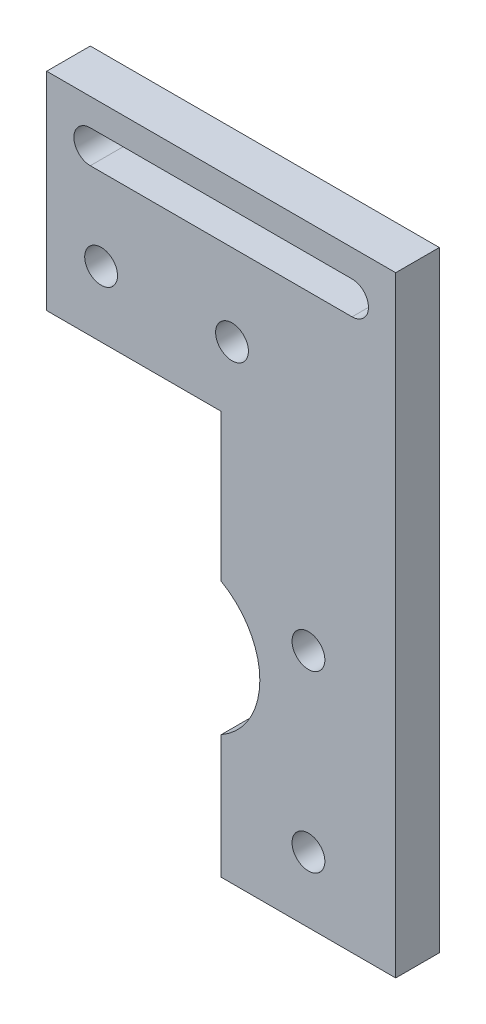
ISO-10303-21;
HEADER;
FILE_DESCRIPTION(('STEP AP214'),'2;1');
FILE_NAME('part.step','',(''),(''),'','','');
FILE_SCHEMA(('AUTOMOTIVE_DESIGN { 1 0 10303 214 1 1 1 1 }'));
ENDSEC;
DATA;
#1=APPLICATION_CONTEXT('core data for automotive mechanical design processes');
#2=APPLICATION_PROTOCOL_DEFINITION('international standard','automotive_design',2000,#1);
#3=PRODUCT_CONTEXT('',#1,'mechanical');
#4=PRODUCT('Part','Part','',(#3));
#5=PRODUCT_RELATED_PRODUCT_CATEGORY('part','',(#4));
#6=PRODUCT_DEFINITION_FORMATION('','',#4);
#7=PRODUCT_DEFINITION_CONTEXT('part definition',#1,'design');
#8=PRODUCT_DEFINITION('design','',#6,#7);
#9=PRODUCT_DEFINITION_SHAPE('','',#8);
#10=(LENGTH_UNIT() NAMED_UNIT(*) SI_UNIT(.MILLI.,.METRE.));
#11=(NAMED_UNIT(*) PLANE_ANGLE_UNIT() SI_UNIT($,.RADIAN.));
#12=(NAMED_UNIT(*) SI_UNIT($,.STERADIAN.) SOLID_ANGLE_UNIT());
#13=UNCERTAINTY_MEASURE_WITH_UNIT(LENGTH_MEASURE(1.E-05),#10,'distance_accuracy_value','');
#14=(GEOMETRIC_REPRESENTATION_CONTEXT(3) GLOBAL_UNCERTAINTY_ASSIGNED_CONTEXT((#13)) GLOBAL_UNIT_ASSIGNED_CONTEXT((#10,
#11,#12)) REPRESENTATION_CONTEXT('',''));
#15=CARTESIAN_POINT('',(0.,0.,0.));
#16=DIRECTION('',(0.,0.,1.));
#17=DIRECTION('',(1.,0.,0.));
#18=AXIS2_PLACEMENT_3D('',#15,#16,#17);
#19=CARTESIAN_POINT('',(0.,0.,6.35));
#20=DIRECTION('',(0.,0.,1.));
#21=DIRECTION('',(1.,0.,0.));
#22=AXIS2_PLACEMENT_3D('',#19,#20,#21);
#23=PLANE('',#22);
#24=DIRECTION('',(1.,0.,0.));
#25=VECTOR('',#24,1.);
#26=CARTESIAN_POINT('',(-31.75,70.6374,6.35));
#27=LINE('',#26,#25);
#28=CARTESIAN_POINT('',(-31.75,70.6374,6.35));
#29=VERTEX_POINT('',#28);
#30=CARTESIAN_POINT('',(6.35,70.6374,6.35));
#31=VERTEX_POINT('',#30);
#32=EDGE_CURVE('E250',#29,#31,#27,.T.);
#33=ORIENTED_EDGE('',*,*,#32,.F.);
#34=CARTESIAN_POINT('',(-31.75,73.025,6.35));
#35=DIRECTION('',(0.,0.,1.));
#36=DIRECTION('',(1.,0.,0.));
#37=AXIS2_PLACEMENT_3D('',#34,#35,#36);
#38=CIRCLE('',#37,2.38759999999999);
#39=CARTESIAN_POINT('',(-31.75,75.4126,6.35));
#40=VERTEX_POINT('',#39);
#41=EDGE_CURVE('E237',#40,#29,#38,.T.);
#42=ORIENTED_EDGE('',*,*,#41,.F.);
#43=DIRECTION('',(-1.,0.,0.));
#44=VECTOR('',#43,1.);
#45=CARTESIAN_POINT('',(-31.75,75.4126,6.35));
#46=LINE('',#45,#44);
#47=CARTESIAN_POINT('',(6.35,75.4126,6.35));
#48=VERTEX_POINT('',#47);
#49=EDGE_CURVE('E233',#48,#40,#46,.T.);
#50=ORIENTED_EDGE('',*,*,#49,.F.);
#51=CARTESIAN_POINT('',(6.35,73.025,6.35));
#52=DIRECTION('',(0.,0.,1.));
#53=DIRECTION('',(1.,0.,0.));
#54=AXIS2_PLACEMENT_3D('',#51,#52,#53);
#55=CIRCLE('',#54,2.38759999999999);
#56=EDGE_CURVE('E248',#31,#48,#55,.T.);
#57=ORIENTED_EDGE('',*,*,#56,.F.);
#58=EDGE_LOOP('',(#33,#42,#50,#57));
#59=FACE_BOUND('',#58,.T.);
#60=CARTESIAN_POINT('',(-30.1752,58.7502,6.35));
#61=DIRECTION('',(0.,0.,1.));
#62=DIRECTION('',(1.,0.,0.));
#63=AXIS2_PLACEMENT_3D('',#60,#61,#62);
#64=CIRCLE('',#63,2.3876);
#65=CARTESIAN_POINT('',(-27.7876,58.7502,6.35));
#66=VERTEX_POINT('',#65);
#67=EDGE_CURVE('E210',#66,#66,#64,.T.);
#68=ORIENTED_EDGE('',*,*,#67,.F.);
#69=EDGE_LOOP('',(#68));
#70=FACE_BOUND('',#69,.T.);
#71=CARTESIAN_POINT('',(0.,0.,6.35));
#72=DIRECTION('',(0.,0.,1.));
#73=DIRECTION('',(1.,0.,0.));
#74=AXIS2_PLACEMENT_3D('',#71,#72,#73);
#75=CIRCLE('',#74,2.3876);
#76=CARTESIAN_POINT('',(2.3876,0.,6.35));
#77=VERTEX_POINT('',#76);
#78=EDGE_CURVE('E144',#77,#77,#75,.T.);
#79=ORIENTED_EDGE('',*,*,#78,.F.);
#80=EDGE_LOOP('',(#79));
#81=FACE_BOUND('',#80,.T.);
#82=CARTESIAN_POINT('',(0.,25.4,6.35));
#83=DIRECTION('',(0.,0.,1.));
#84=DIRECTION('',(1.,0.,0.));
#85=AXIS2_PLACEMENT_3D('',#82,#83,#84);
#86=CIRCLE('',#85,2.3876);
#87=CARTESIAN_POINT('',(2.3876,25.4,6.35));
#88=VERTEX_POINT('',#87);
#89=EDGE_CURVE('E204',#88,#88,#86,.T.);
#90=ORIENTED_EDGE('',*,*,#89,.F.);
#91=EDGE_LOOP('',(#90));
#92=FACE_BOUND('',#91,.T.);
#93=CARTESIAN_POINT('',(-11.1252,58.7502,6.35));
#94=DIRECTION('',(0.,0.,1.));
#95=DIRECTION('',(1.,0.,0.));
#96=AXIS2_PLACEMENT_3D('',#93,#94,#95);
#97=CIRCLE('',#96,2.3876);
#98=CARTESIAN_POINT('',(-8.73759999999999,58.7502,6.35));
#99=VERTEX_POINT('',#98);
#100=EDGE_CURVE('E216',#99,#99,#97,.T.);
#101=ORIENTED_EDGE('',*,*,#100,.F.);
#102=EDGE_LOOP('',(#101));
#103=FACE_BOUND('',#102,.T.);
#104=DIRECTION('',(0.,-1.,0.));
#105=VECTOR('',#104,1.);
#106=CARTESIAN_POINT('',(-12.7,49.1998,6.35));
#107=LINE('',#106,#105);
#108=CARTESIAN_POINT('',(-12.7,49.1998,6.35));
#109=VERTEX_POINT('',#108);
#110=CARTESIAN_POINT('',(-12.7,27.7738986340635,6.35));
#111=VERTEX_POINT('',#110);
#112=EDGE_CURVE('E199',#109,#111,#107,.T.);
#113=ORIENTED_EDGE('',*,*,#112,.T.);
#114=CARTESIAN_POINT('',(-18.1864,18.1102,6.35));
#115=DIRECTION('',(0.,0.,1.));
#116=DIRECTION('',(1.,0.,0.));
#117=AXIS2_PLACEMENT_3D('',#114,#115,#116);
#118=CIRCLE('',#117,11.1125);
#119=CARTESIAN_POINT('',(-12.7,8.44650136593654,6.35));
#120=VERTEX_POINT('',#119);
#121=EDGE_CURVE('E47',#111,#120,#118,.F.);
#122=ORIENTED_EDGE('',*,*,#121,.T.);
#123=CARTESIAN_POINT('',(-12.7,-9.525,6.35));
#124=VERTEX_POINT('',#123);
#125=EDGE_CURVE('E156',#120,#124,#107,.T.);
#126=ORIENTED_EDGE('',*,*,#125,.T.);
#127=DIRECTION('',(1.,0.,0.));
#128=VECTOR('',#127,1.);
#129=CARTESIAN_POINT('',(-12.7,-9.525,6.35));
#130=LINE('',#129,#128);
#131=CARTESIAN_POINT('',(12.7,-9.525,6.35));
#132=VERTEX_POINT('',#131);
#133=EDGE_CURVE('E176',#124,#132,#130,.T.);
#134=ORIENTED_EDGE('',*,*,#133,.T.);
#135=DIRECTION('',(0.,1.,0.));
#136=VECTOR('',#135,1.);
#137=CARTESIAN_POINT('',(12.7,-9.525,6.35));
#138=LINE('',#137,#136);
#139=CARTESIAN_POINT('',(12.7,79.375,6.35));
#140=VERTEX_POINT('',#139);
#141=EDGE_CURVE('E194',#132,#140,#138,.T.);
#142=ORIENTED_EDGE('',*,*,#141,.T.);
#143=DIRECTION('',(-1.,0.,0.));
#144=VECTOR('',#143,1.);
#145=CARTESIAN_POINT('',(12.7,79.375,6.35));
#146=LINE('',#145,#144);
#147=CARTESIAN_POINT('',(-38.1,79.375,6.35));
#148=VERTEX_POINT('',#147);
#149=EDGE_CURVE('E190',#140,#148,#146,.T.);
#150=ORIENTED_EDGE('',*,*,#149,.T.);
#151=DIRECTION('',(0.,-1.,0.));
#152=VECTOR('',#151,1.);
#153=CARTESIAN_POINT('',(-38.1,79.375,6.35));
#154=LINE('',#153,#152);
#155=CARTESIAN_POINT('',(-38.1,49.1998,6.35));
#156=VERTEX_POINT('',#155);
#157=EDGE_CURVE('E193',#148,#156,#154,.T.);
#158=ORIENTED_EDGE('',*,*,#157,.T.);
#159=DIRECTION('',(1.,0.,0.));
#160=VECTOR('',#159,1.);
#161=CARTESIAN_POINT('',(-38.1,49.1998,6.35));
#162=LINE('',#161,#160);
#163=EDGE_CURVE('E146',#156,#109,#162,.T.);
#164=ORIENTED_EDGE('',*,*,#163,.T.);
#165=EDGE_LOOP('',(#113,#122,#126,#134,#142,#150,#158,#164));
#166=FACE_BOUND('',#165,.T.);
#167=ADVANCED_FACE('F33',(#59,#70,#81,#92,#103,#166),#23,.T.);
#168=CARTESIAN_POINT('',(0.,0.,0.));
#169=DIRECTION('',(0.,0.,1.));
#170=DIRECTION('',(1.,0.,0.));
#171=AXIS2_PLACEMENT_3D('',#168,#169,#170);
#172=PLANE('',#171);
#173=CARTESIAN_POINT('',(-31.75,73.025,0.));
#174=DIRECTION('',(0.,0.,1.));
#175=DIRECTION('',(1.,0.,0.));
#176=AXIS2_PLACEMENT_3D('',#173,#174,#175);
#177=CIRCLE('',#176,2.38759999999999);
#178=CARTESIAN_POINT('',(-31.75,75.4126,0.));
#179=VERTEX_POINT('',#178);
#180=CARTESIAN_POINT('',(-31.75,70.6374,0.));
#181=VERTEX_POINT('',#180);
#182=EDGE_CURVE('E244',#179,#181,#177,.T.);
#183=ORIENTED_EDGE('',*,*,#182,.T.);
#184=DIRECTION('',(1.,0.,0.));
#185=VECTOR('',#184,1.);
#186=CARTESIAN_POINT('',(-31.75,70.6374,0.));
#187=LINE('',#186,#185);
#188=CARTESIAN_POINT('',(6.35,70.6374,0.));
#189=VERTEX_POINT('',#188);
#190=EDGE_CURVE('E241',#181,#189,#187,.T.);
#191=ORIENTED_EDGE('',*,*,#190,.T.);
#192=CARTESIAN_POINT('',(6.35,73.025,0.));
#193=DIRECTION('',(0.,0.,1.));
#194=DIRECTION('',(1.,0.,0.));
#195=AXIS2_PLACEMENT_3D('',#192,#193,#194);
#196=CIRCLE('',#195,2.38759999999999);
#197=CARTESIAN_POINT('',(6.35,75.4126,0.));
#198=VERTEX_POINT('',#197);
#199=EDGE_CURVE('E238',#189,#198,#196,.T.);
#200=ORIENTED_EDGE('',*,*,#199,.T.);
#201=DIRECTION('',(-1.,0.,0.));
#202=VECTOR('',#201,1.);
#203=CARTESIAN_POINT('',(-31.75,75.4126,0.));
#204=LINE('',#203,#202);
#205=EDGE_CURVE('E234',#198,#179,#204,.T.);
#206=ORIENTED_EDGE('',*,*,#205,.T.);
#207=EDGE_LOOP('',(#183,#191,#200,#206));
#208=FACE_BOUND('',#207,.T.);
#209=CARTESIAN_POINT('',(-30.1752,58.7502,0.));
#210=DIRECTION('',(0.,0.,1.));
#211=DIRECTION('',(1.,0.,0.));
#212=AXIS2_PLACEMENT_3D('',#209,#210,#211);
#213=CIRCLE('',#212,2.3876);
#214=CARTESIAN_POINT('',(-27.7876,58.7502,0.));
#215=VERTEX_POINT('',#214);
#216=EDGE_CURVE('E213',#215,#215,#213,.T.);
#217=ORIENTED_EDGE('',*,*,#216,.T.);
#218=EDGE_LOOP('',(#217));
#219=FACE_BOUND('',#218,.T.);
#220=CARTESIAN_POINT('',(0.,0.,0.));
#221=DIRECTION('',(0.,0.,1.));
#222=DIRECTION('',(1.,0.,0.));
#223=AXIS2_PLACEMENT_3D('',#220,#221,#222);
#224=CIRCLE('',#223,2.3876);
#225=CARTESIAN_POINT('',(2.3876,0.,0.));
#226=VERTEX_POINT('',#225);
#227=EDGE_CURVE('E201',#226,#226,#224,.T.);
#228=ORIENTED_EDGE('',*,*,#227,.T.);
#229=EDGE_LOOP('',(#228));
#230=FACE_BOUND('',#229,.T.);
#231=CARTESIAN_POINT('',(0.,25.4,0.));
#232=DIRECTION('',(0.,0.,1.));
#233=DIRECTION('',(1.,0.,0.));
#234=AXIS2_PLACEMENT_3D('',#231,#232,#233);
#235=CIRCLE('',#234,2.3876);
#236=CARTESIAN_POINT('',(2.3876,25.4,0.));
#237=VERTEX_POINT('',#236);
#238=EDGE_CURVE('E207',#237,#237,#235,.T.);
#239=ORIENTED_EDGE('',*,*,#238,.T.);
#240=EDGE_LOOP('',(#239));
#241=FACE_BOUND('',#240,.T.);
#242=CARTESIAN_POINT('',(-11.1252,58.7502,0.));
#243=DIRECTION('',(0.,0.,1.));
#244=DIRECTION('',(1.,0.,0.));
#245=AXIS2_PLACEMENT_3D('',#242,#243,#244);
#246=CIRCLE('',#245,2.3876);
#247=CARTESIAN_POINT('',(-8.73759999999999,58.7502,0.));
#248=VERTEX_POINT('',#247);
#249=EDGE_CURVE('E219',#248,#248,#246,.T.);
#250=ORIENTED_EDGE('',*,*,#249,.T.);
#251=EDGE_LOOP('',(#250));
#252=FACE_BOUND('',#251,.T.);
#253=CARTESIAN_POINT('',(-18.1864,18.1102,0.));
#254=DIRECTION('',(0.,0.,1.));
#255=DIRECTION('',(1.,0.,0.));
#256=AXIS2_PLACEMENT_3D('',#253,#254,#255);
#257=CIRCLE('',#256,11.1125);
#258=CARTESIAN_POINT('',(-12.7,8.44650136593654,0.));
#259=VERTEX_POINT('',#258);
#260=CARTESIAN_POINT('',(-12.7,27.7738986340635,0.));
#261=VERTEX_POINT('',#260);
#262=EDGE_CURVE('E120',#259,#261,#257,.T.);
#263=ORIENTED_EDGE('',*,*,#262,.T.);
#264=DIRECTION('',(0.,-1.,0.));
#265=VECTOR('',#264,1.);
#266=CARTESIAN_POINT('',(-12.7,49.1998,0.));
#267=LINE('',#266,#265);
#268=CARTESIAN_POINT('',(-12.7,49.1998,0.));
#269=VERTEX_POINT('',#268);
#270=EDGE_CURVE('E132',#269,#261,#267,.T.);
#271=ORIENTED_EDGE('',*,*,#270,.F.);
#272=DIRECTION('',(1.,0.,0.));
#273=VECTOR('',#272,1.);
#274=CARTESIAN_POINT('',(-38.1,49.1998,0.));
#275=LINE('',#274,#273);
#276=CARTESIAN_POINT('',(-38.1,49.1998,0.));
#277=VERTEX_POINT('',#276);
#278=EDGE_CURVE('E154',#277,#269,#275,.T.);
#279=ORIENTED_EDGE('',*,*,#278,.F.);
#280=DIRECTION('',(0.,-1.,0.));
#281=VECTOR('',#280,1.);
#282=CARTESIAN_POINT('',(-38.1,79.375,0.));
#283=LINE('',#282,#281);
#284=CARTESIAN_POINT('',(-38.1,79.375,0.));
#285=VERTEX_POINT('',#284);
#286=EDGE_CURVE('E152',#285,#277,#283,.T.);
#287=ORIENTED_EDGE('',*,*,#286,.F.);
#288=DIRECTION('',(-1.,0.,0.));
#289=VECTOR('',#288,1.);
#290=CARTESIAN_POINT('',(12.7,79.375,0.));
#291=LINE('',#290,#289);
#292=CARTESIAN_POINT('',(12.7,79.375,0.));
#293=VERTEX_POINT('',#292);
#294=EDGE_CURVE('E150',#293,#285,#291,.T.);
#295=ORIENTED_EDGE('',*,*,#294,.F.);
#296=DIRECTION('',(0.,1.,0.));
#297=VECTOR('',#296,1.);
#298=CARTESIAN_POINT('',(12.7,-9.525,0.));
#299=LINE('',#298,#297);
#300=CARTESIAN_POINT('',(12.7,-9.525,0.));
#301=VERTEX_POINT('',#300);
#302=EDGE_CURVE('E142',#301,#293,#299,.T.);
#303=ORIENTED_EDGE('',*,*,#302,.F.);
#304=DIRECTION('',(1.,0.,0.));
#305=VECTOR('',#304,1.);
#306=CARTESIAN_POINT('',(-12.7,-9.525,0.));
#307=LINE('',#306,#305);
#308=CARTESIAN_POINT('',(-12.7,-9.525,0.));
#309=VERTEX_POINT('',#308);
#310=EDGE_CURVE('E140',#309,#301,#307,.T.);
#311=ORIENTED_EDGE('',*,*,#310,.F.);
#312=EDGE_CURVE('E134',#259,#309,#267,.T.);
#313=ORIENTED_EDGE('',*,*,#312,.F.);
#314=EDGE_LOOP('',(#263,#271,#279,#287,#295,#303,#311,#313));
#315=FACE_BOUND('',#314,.T.);
#316=ADVANCED_FACE('F130',(#208,#219,#230,#241,#252,#315),#172,.F.);
#317=CARTESIAN_POINT('',(-12.7,49.1998,6.35));
#318=DIRECTION('',(1.,0.,0.));
#319=DIRECTION('',(0.,1.,0.));
#320=AXIS2_PLACEMENT_3D('',#317,#318,#319);
#321=PLANE('',#320);
#322=DIRECTION('',(0.,0.,-1.));
#323=VECTOR('',#322,1.);
#324=CARTESIAN_POINT('',(-12.7,8.44650136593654,12.7));
#325=LINE('',#324,#323);
#326=EDGE_CURVE('E11',#259,#120,#325,.F.);
#327=ORIENTED_EDGE('',*,*,#326,.F.);
#328=ORIENTED_EDGE('',*,*,#312,.T.);
#329=DIRECTION('',(0.,0.,-1.));
#330=VECTOR('',#329,1.);
#331=CARTESIAN_POINT('',(-12.7,-9.525,6.35));
#332=LINE('',#331,#330);
#333=EDGE_CURVE('E126',#124,#309,#332,.T.);
#334=ORIENTED_EDGE('',*,*,#333,.F.);
#335=ORIENTED_EDGE('',*,*,#125,.F.);
#336=EDGE_LOOP('',(#327,#328,#334,#335));
#337=FACE_BOUND('',#336,.T.);
#338=ADVANCED_FACE('F35',(#337),#321,.F.);
#339=DIRECTION('',(0.,0.,-1.));
#340=VECTOR('',#339,1.);
#341=CARTESIAN_POINT('',(-12.7,27.7738986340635,12.7));
#342=LINE('',#341,#340);
#343=EDGE_CURVE('E41',#111,#261,#342,.T.);
#344=ORIENTED_EDGE('',*,*,#343,.F.);
#345=ORIENTED_EDGE('',*,*,#112,.F.);
#346=DIRECTION('',(0.,0.,-1.));
#347=VECTOR('',#346,1.);
#348=CARTESIAN_POINT('',(-12.7,49.1998,6.35));
#349=LINE('',#348,#347);
#350=EDGE_CURVE('E139',#109,#269,#349,.T.);
#351=ORIENTED_EDGE('',*,*,#350,.T.);
#352=ORIENTED_EDGE('',*,*,#270,.T.);
#353=EDGE_LOOP('',(#344,#345,#351,#352));
#354=FACE_BOUND('',#353,.T.);
#355=ADVANCED_FACE('F137',(#354),#321,.F.);
#356=CARTESIAN_POINT('',(-12.7,-9.525,6.35));
#357=DIRECTION('',(0.,1.,0.));
#358=DIRECTION('',(0.,0.,1.));
#359=AXIS2_PLACEMENT_3D('',#356,#357,#358);
#360=PLANE('',#359);
#361=ORIENTED_EDGE('',*,*,#310,.T.);
#362=DIRECTION('',(0.,0.,-1.));
#363=VECTOR('',#362,1.);
#364=CARTESIAN_POINT('',(12.7,-9.525,6.35));
#365=LINE('',#364,#363);
#366=EDGE_CURVE('E167',#132,#301,#365,.T.);
#367=ORIENTED_EDGE('',*,*,#366,.F.);
#368=ORIENTED_EDGE('',*,*,#133,.F.);
#369=ORIENTED_EDGE('',*,*,#333,.T.);
#370=EDGE_LOOP('',(#361,#367,#368,#369));
#371=FACE_BOUND('',#370,.T.);
#372=ADVANCED_FACE('F174',(#371),#360,.F.);
#373=CARTESIAN_POINT('',(12.7,-9.525,6.35));
#374=DIRECTION('',(-1.,0.,0.));
#375=DIRECTION('',(0.,-1.,0.));
#376=AXIS2_PLACEMENT_3D('',#373,#374,#375);
#377=PLANE('',#376);
#378=ORIENTED_EDGE('',*,*,#302,.T.);
#379=DIRECTION('',(0.,0.,-1.));
#380=VECTOR('',#379,1.);
#381=CARTESIAN_POINT('',(12.7,79.375,6.35));
#382=LINE('',#381,#380);
#383=EDGE_CURVE('E164',#140,#293,#382,.T.);
#384=ORIENTED_EDGE('',*,*,#383,.F.);
#385=ORIENTED_EDGE('',*,*,#141,.F.);
#386=ORIENTED_EDGE('',*,*,#366,.T.);
#387=EDGE_LOOP('',(#378,#384,#385,#386));
#388=FACE_BOUND('',#387,.T.);
#389=ADVANCED_FACE('F184',(#388),#377,.F.);
#390=CARTESIAN_POINT('',(12.7,79.375,6.35));
#391=DIRECTION('',(0.,-1.,0.));
#392=DIRECTION('',(0.,0.,-1.));
#393=AXIS2_PLACEMENT_3D('',#390,#391,#392);
#394=PLANE('',#393);
#395=ORIENTED_EDGE('',*,*,#294,.T.);
#396=DIRECTION('',(0.,0.,-1.));
#397=VECTOR('',#396,1.);
#398=CARTESIAN_POINT('',(-38.1,79.375,6.35));
#399=LINE('',#398,#397);
#400=EDGE_CURVE('E161',#148,#285,#399,.T.);
#401=ORIENTED_EDGE('',*,*,#400,.F.);
#402=ORIENTED_EDGE('',*,*,#149,.F.);
#403=ORIENTED_EDGE('',*,*,#383,.T.);
#404=EDGE_LOOP('',(#395,#401,#402,#403));
#405=FACE_BOUND('',#404,.T.);
#406=ADVANCED_FACE('F188',(#405),#394,.F.);
#407=CARTESIAN_POINT('',(-38.1,79.375,6.35));
#408=DIRECTION('',(1.,0.,0.));
#409=DIRECTION('',(0.,1.,0.));
#410=AXIS2_PLACEMENT_3D('',#407,#408,#409);
#411=PLANE('',#410);
#412=ORIENTED_EDGE('',*,*,#286,.T.);
#413=DIRECTION('',(0.,0.,-1.));
#414=VECTOR('',#413,1.);
#415=CARTESIAN_POINT('',(-38.1,49.1998,6.35));
#416=LINE('',#415,#414);
#417=EDGE_CURVE('E158',#156,#277,#416,.T.);
#418=ORIENTED_EDGE('',*,*,#417,.F.);
#419=ORIENTED_EDGE('',*,*,#157,.F.);
#420=ORIENTED_EDGE('',*,*,#400,.T.);
#421=EDGE_LOOP('',(#412,#418,#419,#420));
#422=FACE_BOUND('',#421,.T.);
#423=ADVANCED_FACE('F258',(#422),#411,.F.);
#424=CARTESIAN_POINT('',(-38.1,49.1998,6.35));
#425=DIRECTION('',(0.,1.,0.));
#426=DIRECTION('',(0.,0.,1.));
#427=AXIS2_PLACEMENT_3D('',#424,#425,#426);
#428=PLANE('',#427);
#429=ORIENTED_EDGE('',*,*,#278,.T.);
#430=ORIENTED_EDGE('',*,*,#350,.F.);
#431=ORIENTED_EDGE('',*,*,#163,.F.);
#432=ORIENTED_EDGE('',*,*,#417,.T.);
#433=EDGE_LOOP('',(#429,#430,#431,#432));
#434=FACE_BOUND('',#433,.T.);
#435=ADVANCED_FACE('F256',(#434),#428,.F.);
#436=CARTESIAN_POINT('',(0.,0.,6.35));
#437=DIRECTION('',(0.,0.,-1.));
#438=DIRECTION('',(-1.,0.,0.));
#439=AXIS2_PLACEMENT_3D('',#436,#437,#438);
#440=CYLINDRICAL_SURFACE('',#439,2.3876);
#441=ORIENTED_EDGE('',*,*,#78,.T.);
#442=EDGE_LOOP('',(#441));
#443=FACE_BOUND('',#442,.T.);
#444=ORIENTED_EDGE('',*,*,#227,.F.);
#445=EDGE_LOOP('',(#444));
#446=FACE_BOUND('',#445,.T.);
#447=ADVANCED_FACE('F265',(#443,#446),#440,.F.);
#448=CARTESIAN_POINT('',(0.,25.4,6.35));
#449=DIRECTION('',(0.,0.,-1.));
#450=DIRECTION('',(-1.,0.,0.));
#451=AXIS2_PLACEMENT_3D('',#448,#449,#450);
#452=CYLINDRICAL_SURFACE('',#451,2.3876);
#453=ORIENTED_EDGE('',*,*,#89,.T.);
#454=EDGE_LOOP('',(#453));
#455=FACE_BOUND('',#454,.T.);
#456=ORIENTED_EDGE('',*,*,#238,.F.);
#457=EDGE_LOOP('',(#456));
#458=FACE_BOUND('',#457,.T.);
#459=ADVANCED_FACE('F281',(#455,#458),#452,.F.);
#460=CARTESIAN_POINT('',(-30.1752,58.7502,6.35));
#461=DIRECTION('',(0.,0.,-1.));
#462=DIRECTION('',(-1.,0.,0.));
#463=AXIS2_PLACEMENT_3D('',#460,#461,#462);
#464=CYLINDRICAL_SURFACE('',#463,2.3876);
#465=ORIENTED_EDGE('',*,*,#67,.T.);
#466=EDGE_LOOP('',(#465));
#467=FACE_BOUND('',#466,.T.);
#468=ORIENTED_EDGE('',*,*,#216,.F.);
#469=EDGE_LOOP('',(#468));
#470=FACE_BOUND('',#469,.T.);
#471=ADVANCED_FACE('F285',(#467,#470),#464,.F.);
#472=CARTESIAN_POINT('',(-11.1252,58.7502,6.35));
#473=DIRECTION('',(0.,0.,-1.));
#474=DIRECTION('',(-1.,0.,0.));
#475=AXIS2_PLACEMENT_3D('',#472,#473,#474);
#476=CYLINDRICAL_SURFACE('',#475,2.3876);
#477=ORIENTED_EDGE('',*,*,#100,.T.);
#478=EDGE_LOOP('',(#477));
#479=FACE_BOUND('',#478,.T.);
#480=ORIENTED_EDGE('',*,*,#249,.F.);
#481=EDGE_LOOP('',(#480));
#482=FACE_BOUND('',#481,.T.);
#483=ADVANCED_FACE('F289',(#479,#482),#476,.F.);
#484=CARTESIAN_POINT('',(-31.75,73.025,6.35));
#485=DIRECTION('',(0.,0.,-1.));
#486=DIRECTION('',(-1.,0.,0.));
#487=AXIS2_PLACEMENT_3D('',#484,#485,#486);
#488=CYLINDRICAL_SURFACE('',#487,2.38759999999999);
#489=ORIENTED_EDGE('',*,*,#182,.F.);
#490=DIRECTION('',(0.,0.,-1.));
#491=VECTOR('',#490,1.);
#492=CARTESIAN_POINT('',(-31.75,75.4126,6.35));
#493=LINE('',#492,#491);
#494=EDGE_CURVE('E230',#40,#179,#493,.T.);
#495=ORIENTED_EDGE('',*,*,#494,.F.);
#496=ORIENTED_EDGE('',*,*,#41,.T.);
#497=DIRECTION('',(0.,0.,-1.));
#498=VECTOR('',#497,1.);
#499=CARTESIAN_POINT('',(-31.75,70.6374,6.35));
#500=LINE('',#499,#498);
#501=EDGE_CURVE('E222',#29,#181,#500,.T.);
#502=ORIENTED_EDGE('',*,*,#501,.T.);
#503=EDGE_LOOP('',(#489,#495,#496,#502));
#504=FACE_BOUND('',#503,.T.);
#505=ADVANCED_FACE('F293',(#504),#488,.F.);
#506=CARTESIAN_POINT('',(-31.75,70.6374,6.35));
#507=DIRECTION('',(0.,1.,0.));
#508=DIRECTION('',(0.,0.,1.));
#509=AXIS2_PLACEMENT_3D('',#506,#507,#508);
#510=PLANE('',#509);
#511=ORIENTED_EDGE('',*,*,#190,.F.);
#512=ORIENTED_EDGE('',*,*,#501,.F.);
#513=ORIENTED_EDGE('',*,*,#32,.T.);
#514=DIRECTION('',(0.,0.,-1.));
#515=VECTOR('',#514,1.);
#516=CARTESIAN_POINT('',(6.35,70.6374,6.35));
#517=LINE('',#516,#515);
#518=EDGE_CURVE('E227',#31,#189,#517,.T.);
#519=ORIENTED_EDGE('',*,*,#518,.T.);
#520=EDGE_LOOP('',(#511,#512,#513,#519));
#521=FACE_BOUND('',#520,.T.);
#522=ADVANCED_FACE('F297',(#521),#510,.T.);
#523=CARTESIAN_POINT('',(6.35,73.025,6.35));
#524=DIRECTION('',(0.,0.,-1.));
#525=DIRECTION('',(-1.,0.,0.));
#526=AXIS2_PLACEMENT_3D('',#523,#524,#525);
#527=CYLINDRICAL_SURFACE('',#526,2.38759999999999);
#528=ORIENTED_EDGE('',*,*,#199,.F.);
#529=ORIENTED_EDGE('',*,*,#518,.F.);
#530=ORIENTED_EDGE('',*,*,#56,.T.);
#531=DIRECTION('',(0.,0.,-1.));
#532=VECTOR('',#531,1.);
#533=CARTESIAN_POINT('',(6.35,75.4126,6.35));
#534=LINE('',#533,#532);
#535=EDGE_CURVE('E55',#48,#198,#534,.T.);
#536=ORIENTED_EDGE('',*,*,#535,.T.);
#537=EDGE_LOOP('',(#528,#529,#530,#536));
#538=FACE_BOUND('',#537,.T.);
#539=ADVANCED_FACE('F301',(#538),#527,.F.);
#540=CARTESIAN_POINT('',(-31.75,75.4126,6.35));
#541=DIRECTION('',(0.,-1.,0.));
#542=DIRECTION('',(0.,0.,-1.));
#543=AXIS2_PLACEMENT_3D('',#540,#541,#542);
#544=PLANE('',#543);
#545=ORIENTED_EDGE('',*,*,#205,.F.);
#546=ORIENTED_EDGE('',*,*,#535,.F.);
#547=ORIENTED_EDGE('',*,*,#49,.T.);
#548=ORIENTED_EDGE('',*,*,#494,.T.);
#549=EDGE_LOOP('',(#545,#546,#547,#548));
#550=FACE_BOUND('',#549,.T.);
#551=ADVANCED_FACE('F305',(#550),#544,.T.);
#552=CARTESIAN_POINT('',(-18.1864,18.1102,12.7));
#553=DIRECTION('',(0.,0.,-1.));
#554=DIRECTION('',(-1.,0.,0.));
#555=AXIS2_PLACEMENT_3D('',#552,#553,#554);
#556=CYLINDRICAL_SURFACE('',#555,11.1125);
#557=ORIENTED_EDGE('',*,*,#326,.T.);
#558=ORIENTED_EDGE('',*,*,#121,.F.);
#559=ORIENTED_EDGE('',*,*,#343,.T.);
#560=ORIENTED_EDGE('',*,*,#262,.F.);
#561=EDGE_LOOP('',(#557,#558,#559,#560));
#562=FACE_BOUND('',#561,.T.);
#563=ADVANCED_FACE('F119',(#562),#556,.F.);
#564=CLOSED_SHELL('',(#167,#316,#338,#355,#372,#389,#406,#423,#435,#447,#459,#471,#483,#505,
#522,#539,#551,#563));
#565=MANIFOLD_SOLID_BREP('B2',#564);
#566=ADVANCED_BREP_SHAPE_REPRESENTATION('',(#18,#565),#14);
#567=SHAPE_DEFINITION_REPRESENTATION(#9,#566);
ENDSEC;
END-ISO-10303-21;
